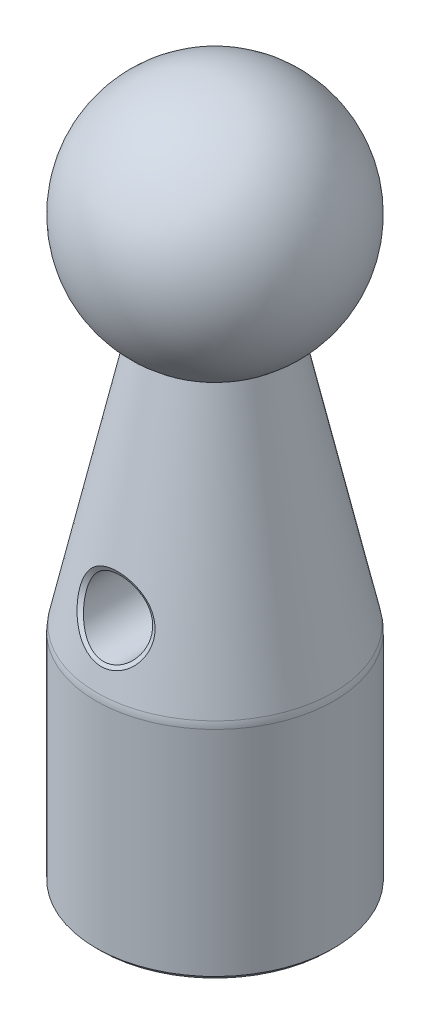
ISO-10303-21;
HEADER;
FILE_DESCRIPTION(('STEP AP214'),'2;1');
FILE_NAME('part.step','',(''),(''),'','','');
FILE_SCHEMA(('AUTOMOTIVE_DESIGN { 1 0 10303 214 1 1 1 1 }'));
ENDSEC;
DATA;
#1=APPLICATION_CONTEXT('core data for automotive mechanical design processes');
#2=APPLICATION_PROTOCOL_DEFINITION('international standard','automotive_design',2000,#1);
#3=PRODUCT_CONTEXT('',#1,'mechanical');
#4=PRODUCT('Part','Part','',(#3));
#5=PRODUCT_RELATED_PRODUCT_CATEGORY('part','',(#4));
#6=PRODUCT_DEFINITION_FORMATION('','',#4);
#7=PRODUCT_DEFINITION_CONTEXT('part definition',#1,'design');
#8=PRODUCT_DEFINITION('design','',#6,#7);
#9=PRODUCT_DEFINITION_SHAPE('','',#8);
#10=(LENGTH_UNIT() NAMED_UNIT(*) SI_UNIT(.MILLI.,.METRE.));
#11=(NAMED_UNIT(*) PLANE_ANGLE_UNIT() SI_UNIT($,.RADIAN.));
#12=(NAMED_UNIT(*) SI_UNIT($,.STERADIAN.) SOLID_ANGLE_UNIT());
#13=UNCERTAINTY_MEASURE_WITH_UNIT(LENGTH_MEASURE(1.E-05),#10,'distance_accuracy_value','');
#14=(GEOMETRIC_REPRESENTATION_CONTEXT(3) GLOBAL_UNCERTAINTY_ASSIGNED_CONTEXT((#13)) GLOBAL_UNIT_ASSIGNED_CONTEXT((#10,
#11,#12)) REPRESENTATION_CONTEXT('',''));
#15=CARTESIAN_POINT('',(0.,0.,0.));
#16=DIRECTION('',(0.,0.,1.));
#17=DIRECTION('',(1.,0.,0.));
#18=AXIS2_PLACEMENT_3D('',#15,#16,#17);
#19=CARTESIAN_POINT('',(0.,0.,0.));
#20=DIRECTION('',(0.,-1.,0.));
#21=DIRECTION('',(0.,0.,-1.));
#22=AXIS2_PLACEMENT_3D('',#19,#20,#21);
#23=PLANE('',#22);
#24=CARTESIAN_POINT('',(0.,0.,0.));
#25=DIRECTION('',(0.,-1.,0.));
#26=DIRECTION('',(0.,0.,-1.));
#27=AXIS2_PLACEMENT_3D('',#24,#25,#26);
#28=CIRCLE('',#27,9.144);
#29=CARTESIAN_POINT('',(0.,0.,-9.144));
#30=VERTEX_POINT('',#29);
#31=EDGE_CURVE('E193',#30,#30,#28,.T.);
#32=ORIENTED_EDGE('',*,*,#31,.T.);
#33=EDGE_LOOP('',(#32));
#34=FACE_BOUND('',#33,.T.);
#35=CARTESIAN_POINT('',(0.,0.,0.));
#36=DIRECTION('',(0.,-1.,0.));
#37=DIRECTION('',(0.,0.,-1.));
#38=AXIS2_PLACEMENT_3D('',#35,#36,#37);
#39=CIRCLE('',#38,6.35);
#40=CARTESIAN_POINT('',(0.,0.,-6.35));
#41=VERTEX_POINT('',#40);
#42=EDGE_CURVE('E64',#41,#41,#39,.T.);
#43=ORIENTED_EDGE('',*,*,#42,.F.);
#44=EDGE_LOOP('',(#43));
#45=FACE_BOUND('',#44,.T.);
#46=ADVANCED_FACE('F37',(#34,#45),#23,.T.);
#47=CARTESIAN_POINT('',(0.,0.,0.));
#48=DIRECTION('',(0.,-1.,0.));
#49=DIRECTION('',(0.,0.,-1.));
#50=AXIS2_PLACEMENT_3D('',#47,#48,#49);
#51=CYLINDRICAL_SURFACE('',#50,9.525);
#52=CARTESIAN_POINT('',(0.,17.5026292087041,0.));
#53=DIRECTION('',(0.,1.,0.));
#54=DIRECTION('',(0.,0.,1.));
#55=AXIS2_PLACEMENT_3D('',#52,#53,#54);
#56=CIRCLE('',#55,9.525);
#57=CARTESIAN_POINT('',(0.,17.5026292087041,9.525));
#58=VERTEX_POINT('',#57);
#59=EDGE_CURVE('E43',#58,#58,#56,.F.);
#60=ORIENTED_EDGE('',*,*,#59,.T.);
#61=EDGE_LOOP('',(#60));
#62=FACE_BOUND('',#61,.T.);
#63=CARTESIAN_POINT('',(0.,0.381000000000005,0.));
#64=DIRECTION('',(0.,-1.,0.));
#65=DIRECTION('',(0.,0.,-1.));
#66=AXIS2_PLACEMENT_3D('',#63,#64,#65);
#67=CIRCLE('',#66,9.525);
#68=CARTESIAN_POINT('',(0.,0.381000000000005,-9.525));
#69=VERTEX_POINT('',#68);
#70=EDGE_CURVE('E201',#69,#69,#67,.F.);
#71=ORIENTED_EDGE('',*,*,#70,.T.);
#72=EDGE_LOOP('',(#71));
#73=FACE_BOUND('',#72,.T.);
#74=ADVANCED_FACE('F187',(#62,#73),#51,.T.);
#75=CARTESIAN_POINT('',(0.,17.78,0.));
#76=DIRECTION('',(0.,-1.,0.));
#77=DIRECTION('',(0.,0.,-1.));
#78=AXIS2_PLACEMENT_3D('',#75,#76,#77);
#79=CONICAL_SURFACE('',#78,9.525,0.217540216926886);
#80=CARTESIAN_POINT('',(0.,18.0508335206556,0.));
#81=DIRECTION('',(0.,1.,0.));
#82=DIRECTION('',(0.,0.,1.));
#83=AXIS2_PLACEMENT_3D('',#80,#81,#82);
#84=CIRCLE('',#83,9.4651354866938);
#85=CARTESIAN_POINT('',(0.,18.0508335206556,9.4651354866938));
#86=VERTEX_POINT('',#85);
#87=EDGE_CURVE('E12',#86,#86,#84,.T.);
#88=ORIENTED_EDGE('',*,*,#87,.T.);
#89=EDGE_LOOP('',(#88));
#90=FACE_BOUND('',#89,.T.);
#91=CARTESIAN_POINT('',(-2.16574098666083,20.5716040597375,8.64066701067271));
#92=CARTESIAN_POINT('',(-1.63110741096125,20.0334121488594,8.8992910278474));
#93=CARTESIAN_POINT('',(-0.850260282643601,19.6889659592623,9.09973912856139));
#94=CARTESIAN_POINT('',(0.780079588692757,19.6698379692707,9.110445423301));
#95=CARTESIAN_POINT('',(1.56445408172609,19.9948996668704,8.92050713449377));
#96=CARTESIAN_POINT('',(2.65991978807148,21.0438115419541,8.41109568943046));
#97=CARTESIAN_POINT('',(2.99644900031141,21.7650303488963,8.11023459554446));
#98=CARTESIAN_POINT('',(3.06492684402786,23.3067077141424,7.71629279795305));
#99=CARTESIAN_POINT('',(2.76295276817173,24.1111669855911,7.65673993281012));
#100=CARTESIAN_POINT('',(1.64858285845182,25.2607208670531,7.71999163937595));
#101=CARTESIAN_POINT('',(0.851139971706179,25.6042588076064,7.79163842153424));
#102=CARTESIAN_POINT('',(-0.776465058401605,25.62276664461,7.79517394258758));
#103=CARTESIAN_POINT('',(-1.58261807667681,25.2990407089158,7.72621323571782));
#104=CARTESIAN_POINT('',(-2.72892700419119,24.1738189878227,7.65567655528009));
#105=CARTESIAN_POINT('',(-3.04775931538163,23.3764001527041,7.70637557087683));
#106=CARTESIAN_POINT('',(-3.01754042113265,21.8373751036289,8.08502125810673));
#107=CARTESIAN_POINT('',(-2.70037456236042,21.1097959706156,8.38204299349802));
#108=CARTESIAN_POINT('',(-2.16574098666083,20.5716040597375,8.64066701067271));
#109=B_SPLINE_CURVE_WITH_KNOTS('',3,(#91,#92,#93,#94,#95,#96,#97,#98,#99,#100,#101,#102,#103,
#104,#105,#106,#107,#108),.UNSPECIFIED.,.T.,.F.,(4,2,2,2,2,2,2,2,4),(-0.0188502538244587,
-0.016480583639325,-0.0141109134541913,-0.0117412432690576,-0.00937157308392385,
-0.00700190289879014,-0.00463223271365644,-0.00226256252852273,0.000107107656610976),.UNSPECIFIED.);
#110=CARTESIAN_POINT('',(-2.16574098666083,20.5716040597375,8.64066701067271));
#111=VERTEX_POINT('',#110);
#112=EDGE_CURVE('E133',#111,#111,#109,.F.);
#113=ORIENTED_EDGE('',*,*,#112,.T.);
#114=EDGE_LOOP('',(#113));
#115=FACE_BOUND('',#114,.T.);
#116=CARTESIAN_POINT('',(-2.16577837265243,20.5715723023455,-8.64066487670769));
#117=CARTESIAN_POINT('',(-2.69886558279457,21.1075533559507,-8.38308124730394));
#118=CARTESIAN_POINT('',(-3.0193195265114,21.837934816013,-8.08419906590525));
#119=CARTESIAN_POINT('',(-3.04632087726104,23.3857042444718,-7.70473130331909));
#120=CARTESIAN_POINT('',(-2.7228543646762,24.1817388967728,-7.65580023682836));
#121=CARTESIAN_POINT('',(-1.57593556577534,25.3039308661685,-7.7267191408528));
#122=CARTESIAN_POINT('',(-0.769490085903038,25.6259083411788,-7.79562132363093));
#123=CARTESIAN_POINT('',(0.859142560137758,25.6010738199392,-7.79112165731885));
#124=CARTESIAN_POINT('',(1.65544808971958,25.2566333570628,-7.7192983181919));
#125=CARTESIAN_POINT('',(2.77114448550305,24.0999081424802,-7.65663541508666));
#126=CARTESIAN_POINT('',(3.06647734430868,23.2943442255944,-7.71856798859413));
#127=CARTESIAN_POINT('',(2.99439231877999,21.7604258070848,-8.11216938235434));
#128=CARTESIAN_POINT('',(2.65882039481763,21.0413110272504,-8.41205397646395));
#129=CARTESIAN_POINT('',(1.55910535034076,19.9911435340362,-8.92254254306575));
#130=CARTESIAN_POINT('',(0.766981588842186,19.6671587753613,-9.11205523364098));
#131=CARTESIAN_POINT('',(-0.861321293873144,19.6919384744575,-9.09795534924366));
#132=CARTESIAN_POINT('',(-1.63269116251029,20.0355912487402,-8.89824850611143));
#133=CARTESIAN_POINT('',(-2.16577837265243,20.5715723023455,-8.64066487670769));
#134=B_SPLINE_CURVE_WITH_KNOTS('',3,(#116,#117,#118,#119,#120,#121,#122,#123,#124,#125,#126,
#127,#128,#129,#130,#131,#132,#133),.UNSPECIFIED.,.T.,.F.,(4,2,2,2,2,2,2,2,4),
(-0.0185591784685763,-0.0161978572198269,-0.0138365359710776,-0.0114752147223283,
-0.00911389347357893,-0.0067525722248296,-0.00439125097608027,-0.00202992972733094,
0.000331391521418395),.UNSPECIFIED.);
#135=CARTESIAN_POINT('',(-2.16577837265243,20.5715723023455,-8.64066487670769));
#136=VERTEX_POINT('',#135);
#137=EDGE_CURVE('E174',#136,#136,#134,.F.);
#138=ORIENTED_EDGE('',*,*,#137,.T.);
#139=EDGE_LOOP('',(#138));
#140=FACE_BOUND('',#139,.T.);
#141=CARTESIAN_POINT('',(0.,38.354,0.));
#142=DIRECTION('',(0.,-1.,0.));
#143=DIRECTION('',(0.,0.,-1.));
#144=AXIS2_PLACEMENT_3D('',#141,#142,#143);
#145=CIRCLE('',#144,4.97736315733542);
#146=CARTESIAN_POINT('',(0.,38.354,-4.97736315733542));
#147=VERTEX_POINT('',#146);
#148=EDGE_CURVE('E70',#147,#147,#145,.T.);
#149=ORIENTED_EDGE('',*,*,#148,.T.);
#150=EDGE_LOOP('',(#149));
#151=FACE_BOUND('',#150,.T.);
#152=ADVANCED_FACE('F179',(#90,#115,#140,#151),#79,.T.);
#153=CARTESIAN_POINT('',(0.,46.4750517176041,0.));
#154=DIRECTION('',(0.,-1.,0.));
#155=DIRECTION('',(1.,0.,0.));
#156=AXIS2_PLACEMENT_3D('',#153,#154,#155);
#157=SPHERICAL_SURFACE('',#156,9.525);
#158=ORIENTED_EDGE('',*,*,#148,.F.);
#159=EDGE_LOOP('',(#158));
#160=FACE_BOUND('',#159,.T.);
#161=ADVANCED_FACE('F159',(#160),#157,.T.);
#162=CARTESIAN_POINT('',(0.,22.606,-9.525));
#163=DIRECTION('',(0.,0.,1.));
#164=DIRECTION('',(1.,0.,0.));
#165=AXIS2_PLACEMENT_3D('',#162,#163,#164);
#166=CYLINDRICAL_SURFACE('',#165,2.667);
#167=CARTESIAN_POINT('',(-1.90657382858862,20.741096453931,8.46307114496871));
#168=CARTESIAN_POINT('',(-1.93596278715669,20.771336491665,8.4470870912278));
#169=CARTESIAN_POINT('',(-1.96459402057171,20.8022342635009,8.43095741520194));
#170=CARTESIAN_POINT('',(-2.02032003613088,20.86529448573,8.39846927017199));
#171=CARTESIAN_POINT('',(-2.04741422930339,20.8974574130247,8.38211071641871));
#172=CARTESIAN_POINT('',(-2.10002984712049,20.9629828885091,8.34923510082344));
#173=CARTESIAN_POINT('',(-2.1255508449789,20.9963457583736,8.33271799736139));
#174=CARTESIAN_POINT('',(-2.17498399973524,21.0642068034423,8.29959523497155));
#175=CARTESIAN_POINT('',(-2.19889597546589,21.098705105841,8.28298956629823));
#176=CARTESIAN_POINT('',(-2.24507483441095,21.168772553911,8.24975973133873));
#177=CARTESIAN_POINT('',(-2.26734184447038,21.2043416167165,8.23313556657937));
#178=CARTESIAN_POINT('',(-2.31019448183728,21.2764861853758,8.19993879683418));
#179=CARTESIAN_POINT('',(-2.33078058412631,21.3130614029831,8.18336617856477));
#180=CARTESIAN_POINT('',(-2.37023506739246,21.3871538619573,8.15034259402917));
#181=CARTESIAN_POINT('',(-2.38910428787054,21.4246706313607,8.13389157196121));
#182=CARTESIAN_POINT('',(-2.42508865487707,21.5005817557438,8.10118129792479));
#183=CARTESIAN_POINT('',(-2.44220499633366,21.5389754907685,8.08492192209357));
#184=CARTESIAN_POINT('',(-2.47464725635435,21.6165760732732,8.05266508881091));
#185=CARTESIAN_POINT('',(-2.48997468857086,21.6557821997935,8.03666741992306));
#186=CARTESIAN_POINT('',(-2.51880283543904,21.734943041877,8.00500415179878));
#187=CARTESIAN_POINT('',(-2.53230531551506,21.7748969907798,7.98933824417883));
#188=CARTESIAN_POINT('',(-2.55744726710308,21.8554889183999,7.95840871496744));
#189=CARTESIAN_POINT('',(-2.56908865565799,21.8961261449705,7.94314469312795));
#190=CARTESIAN_POINT('',(-2.5904724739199,21.9780199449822,7.91308892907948));
#191=CARTESIAN_POINT('',(-2.6002168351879,22.0192758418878,7.89829671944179));
#192=CARTESIAN_POINT('',(-2.61776989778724,22.1023424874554,7.86925534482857));
#193=CARTESIAN_POINT('',(-2.62558036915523,22.1441526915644,7.85500569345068));
#194=CARTESIAN_POINT('',(-2.63923244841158,22.2282624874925,7.82711716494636));
#195=CARTESIAN_POINT('',(-2.64507544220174,22.2705617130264,7.81347786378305));
#196=CARTESIAN_POINT('',(-2.65474722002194,22.3555874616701,7.78688879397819));
#197=CARTESIAN_POINT('',(-2.65857674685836,22.3983138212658,7.77393877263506));
#198=CARTESIAN_POINT('',(-2.66422263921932,22.4841189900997,7.74876544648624));
#199=CARTESIAN_POINT('',(-2.66603878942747,22.5271978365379,7.73654221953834));
#200=CARTESIAN_POINT('',(-2.66748583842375,22.6136026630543,7.71303543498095));
#201=CARTESIAN_POINT('',(-2.66711906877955,22.6569283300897,7.70175088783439));
#202=CARTESIAN_POINT('',(-2.66409147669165,22.7436665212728,7.68024435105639));
#203=CARTESIAN_POINT('',(-2.66143545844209,22.7870786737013,7.67002018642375));
#204=CARTESIAN_POINT('',(-2.65390230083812,22.8738656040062,7.65057582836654));
#205=CARTESIAN_POINT('',(-2.64902846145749,22.9172403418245,7.6413541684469));
#206=CARTESIAN_POINT('',(-2.63708603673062,23.0038393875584,7.62389833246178));
#207=CARTESIAN_POINT('',(-2.6300196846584,23.0470638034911,7.61566316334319));
#208=CARTESIAN_POINT('',(-2.61373058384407,23.1332463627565,7.60015278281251));
#209=CARTESIAN_POINT('',(-2.60450928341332,23.1762046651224,7.59287693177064));
#210=CARTESIAN_POINT('',(-2.58394504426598,23.2617400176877,7.57926078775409));
#211=CARTESIAN_POINT('',(-2.5726030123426,23.3043172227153,7.57292009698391));
#212=CARTESIAN_POINT('',(-2.54783271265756,23.3889752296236,7.56114917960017));
#213=CARTESIAN_POINT('',(-2.53440499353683,23.4310561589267,7.55571871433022));
#214=CARTESIAN_POINT('',(-2.50549830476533,23.5146065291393,7.5457434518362));
#215=CARTESIAN_POINT('',(-2.49001965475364,23.5560760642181,7.54119851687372));
#216=CARTESIAN_POINT('',(-2.45704602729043,23.6382885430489,7.53296950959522));
#217=CARTESIAN_POINT('',(-2.43955121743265,23.6790315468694,7.5292853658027));
#218=CARTESIAN_POINT('',(-2.40258009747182,23.7596758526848,7.52275321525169));
#219=CARTESIAN_POINT('',(-2.38310383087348,23.7995771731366,7.51990519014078));
#220=CARTESIAN_POINT('',(-2.34220461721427,23.8784230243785,7.51502044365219));
#221=CARTESIAN_POINT('',(-2.32078157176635,23.9173675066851,7.5129837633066));
#222=CARTESIAN_POINT('',(-2.27602358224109,23.9941845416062,7.5096973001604));
#223=CARTESIAN_POINT('',(-2.25268833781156,24.0320569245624,7.50844764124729));
#224=CARTESIAN_POINT('',(-2.20414099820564,24.1066149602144,7.50670917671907));
#225=CARTESIAN_POINT('',(-2.17892830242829,24.1433002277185,7.50622061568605));
#226=CARTESIAN_POINT('',(-2.12666043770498,24.2153682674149,7.50598429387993));
#227=CARTESIAN_POINT('',(-2.09960423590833,24.2507502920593,7.50623695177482));
#228=CARTESIAN_POINT('',(-2.04368673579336,24.3201001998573,7.50744044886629));
#229=CARTESIAN_POINT('',(-2.01482381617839,24.3540667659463,7.50839192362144));
#230=CARTESIAN_POINT('',(-1.9553196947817,24.4204595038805,7.51103451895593));
#231=CARTESIAN_POINT('',(-1.92467609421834,24.4528834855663,7.51272665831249));
#232=CARTESIAN_POINT('',(-1.86172842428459,24.5160695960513,7.51657424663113));
#233=CARTESIAN_POINT('',(-1.82942372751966,24.5468310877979,7.51872987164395));
#234=CARTESIAN_POINT('',(-1.76332486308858,24.606642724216,7.52320449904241));
#235=CARTESIAN_POINT('',(-1.7295318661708,24.6356941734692,7.52552337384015));
#236=CARTESIAN_POINT('',(-1.66054534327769,24.6920328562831,7.53034146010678));
#237=CARTESIAN_POINT('',(-1.62535249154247,24.7193209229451,7.53284058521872));
#238=CARTESIAN_POINT('',(-1.55366492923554,24.7720953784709,7.53795187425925));
#239=CARTESIAN_POINT('',(-1.51717059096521,24.7975822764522,7.5405640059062));
#240=CARTESIAN_POINT('',(-1.4429758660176,24.8467125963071,7.54585661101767));
#241=CARTESIAN_POINT('',(-1.40527569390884,24.8703563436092,7.54853707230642));
#242=CARTESIAN_POINT('',(-1.32876569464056,24.9157595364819,7.55391561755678));
#243=CARTESIAN_POINT('',(-1.28995601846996,24.9375192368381,7.5566136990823));
#244=CARTESIAN_POINT('',(-1.21132312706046,24.9791130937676,7.56197839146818));
#245=CARTESIAN_POINT('',(-1.17150005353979,24.9989475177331,7.56464500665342));
#246=CARTESIAN_POINT('',(-1.09093648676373,25.0366495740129,7.56989723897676));
#247=CARTESIAN_POINT('',(-1.05019614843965,25.0545175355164,7.57248286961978));
#248=CARTESIAN_POINT('',(-0.967894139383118,25.0882453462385,7.57752371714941));
#249=CARTESIAN_POINT('',(-0.9263326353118,25.1041055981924,7.5799789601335));
#250=CARTESIAN_POINT('',(-0.842484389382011,25.1337766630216,7.58470958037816));
#251=CARTESIAN_POINT('',(-0.800197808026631,25.1475879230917,7.58698499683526));
#252=CARTESIAN_POINT('',(-0.714995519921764,25.1731197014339,7.5913065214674));
#253=CARTESIAN_POINT('',(-0.672079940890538,25.1848406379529,7.59335267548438));
#254=CARTESIAN_POINT('',(-0.585715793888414,25.2061505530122,7.59716623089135));
#255=CARTESIAN_POINT('',(-0.542267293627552,25.2157397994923,7.59893366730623));
#256=CARTESIAN_POINT('',(-0.454933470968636,25.232745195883,7.60214038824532));
#257=CARTESIAN_POINT('',(-0.411048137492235,25.2401612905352,7.60357966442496));
#258=CARTESIAN_POINT('',(-0.322936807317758,25.2527795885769,7.60608060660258));
#259=CARTESIAN_POINT('',(-0.278710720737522,25.2579811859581,7.6071421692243));
#260=CARTESIAN_POINT('',(-0.190014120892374,25.2661292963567,7.6088386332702));
#261=CARTESIAN_POINT('',(-0.145543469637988,25.2690743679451,7.60947326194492));
#262=CARTESIAN_POINT('',(-0.0564536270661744,25.2726708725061,7.61026557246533));
#263=CARTESIAN_POINT('',(-0.0118343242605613,25.2733196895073,7.61042271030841));
#264=CARTESIAN_POINT('',(0.0773747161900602,25.2722776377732,7.61021496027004));
#265=CARTESIAN_POINT('',(0.121964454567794,25.270586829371,7.60985008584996));
#266=CARTESIAN_POINT('',(0.21093624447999,25.2648980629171,7.60865298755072));
#267=CARTESIAN_POINT('',(0.255318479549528,25.2609028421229,7.60782131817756));
#268=CARTESIAN_POINT('',(0.343780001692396,25.2506538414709,7.60574198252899));
#269=CARTESIAN_POINT('',(0.387859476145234,25.2444016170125,7.60449460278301));
#270=CARTESIAN_POINT('',(0.47561994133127,25.229684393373,7.60163637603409));
#271=CARTESIAN_POINT('',(0.519301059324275,25.2212201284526,7.60002564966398));
#272=CARTESIAN_POINT('',(0.606169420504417,25.2021248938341,7.59649281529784));
#273=CARTESIAN_POINT('',(0.649356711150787,25.1914941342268,7.5945707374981));
#274=CARTESIAN_POINT('',(0.735142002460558,25.1681115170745,7.59046731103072));
#275=CARTESIAN_POINT('',(0.777739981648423,25.1553595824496,7.58828595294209));
#276=CARTESIAN_POINT('',(0.862251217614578,25.1277800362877,7.58371600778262));
#277=CARTESIAN_POINT('',(0.90416441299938,25.1129522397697,7.58132740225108));
#278=CARTESIAN_POINT('',(0.987210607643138,25.0812662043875,7.57639498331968));
#279=CARTESIAN_POINT('',(1.02834354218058,25.0644077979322,7.57385115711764));
#280=CARTESIAN_POINT('',(1.10973369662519,25.0287056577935,7.5686603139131));
#281=CARTESIAN_POINT('',(1.1499908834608,25.0098618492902,7.56601329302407));
#282=CARTESIAN_POINT('',(1.22953398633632,24.9702339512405,7.56066804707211));
#283=CARTESIAN_POINT('',(1.2688199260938,24.9494499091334,7.55796982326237));
#284=CARTESIAN_POINT('',(1.34632493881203,24.9059865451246,7.55257427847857));
#285=CARTESIAN_POINT('',(1.38454409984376,24.8833073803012,7.54987695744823));
#286=CARTESIAN_POINT('',(1.45981999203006,24.8360988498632,7.54453490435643));
#287=CARTESIAN_POINT('',(1.49687685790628,24.8115696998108,7.5418901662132));
#288=CARTESIAN_POINT('',(1.56973245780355,24.7607060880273,7.53670656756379));
#289=CARTESIAN_POINT('',(1.60553132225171,24.7343718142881,7.53416769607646));
#290=CARTESIAN_POINT('',(1.67577585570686,24.6799438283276,7.52924315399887));
#291=CARTESIAN_POINT('',(1.71022155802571,24.6518501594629,7.52685747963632));
#292=CARTESIAN_POINT('',(1.77766261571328,24.5939460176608,7.52230889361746));
#293=CARTESIAN_POINT('',(1.81065776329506,24.5641353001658,7.52014601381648));
#294=CARTESIAN_POINT('',(1.87510886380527,24.5028523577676,7.51602948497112));
#295=CARTESIAN_POINT('',(1.90656416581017,24.4713794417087,7.5140759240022));
#296=CARTESIAN_POINT('',(1.96778419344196,24.4068148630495,7.51067641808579));
#297=CARTESIAN_POINT('',(1.99754930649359,24.3737235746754,7.50923035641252));
#298=CARTESIAN_POINT('',(2.05529188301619,24.3060355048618,7.50711529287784));
#299=CARTESIAN_POINT('',(2.08327065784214,24.271439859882,7.50644571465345));
#300=CARTESIAN_POINT('',(2.13741317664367,24.2008687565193,7.50583928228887));
#301=CARTESIAN_POINT('',(2.16357748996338,24.1648937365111,7.50590219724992));
#302=CARTESIAN_POINT('',(2.21405464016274,24.0916774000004,7.50679964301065));
#303=CARTESIAN_POINT('',(2.23836749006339,24.0544360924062,7.50763416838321));
#304=CARTESIAN_POINT('',(2.28510744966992,23.9788036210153,7.51009155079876));
#305=CARTESIAN_POINT('',(2.30753417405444,23.9404122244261,7.51171456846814));
#306=CARTESIAN_POINT('',(2.3504668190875,23.8625949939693,7.51577167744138));
#307=CARTESIAN_POINT('',(2.37097208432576,23.8231688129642,7.51820604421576));
#308=CARTESIAN_POINT('',(2.41002678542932,23.7433975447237,7.52390705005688));
#309=CARTESIAN_POINT('',(2.42857538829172,23.7030520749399,7.52717404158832));
#310=CARTESIAN_POINT('',(2.46368159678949,23.6215576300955,7.53456196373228));
#311=CARTESIAN_POINT('',(2.48023824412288,23.5804082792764,7.53868330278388));
#312=CARTESIAN_POINT('',(2.51132533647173,23.4974214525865,7.54780148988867));
#313=CARTESIAN_POINT('',(2.52585470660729,23.4555836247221,7.55279879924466));
#314=CARTESIAN_POINT('',(2.5528520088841,23.3713352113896,7.56369054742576));
#315=CARTESIAN_POINT('',(2.56531871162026,23.3289243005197,7.56958551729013));
#316=CARTESIAN_POINT('',(2.58815554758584,23.2436450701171,7.58229412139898));
#317=CARTESIAN_POINT('',(2.59852420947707,23.2007764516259,7.58910839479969));
#318=CARTESIAN_POINT('',(2.61712967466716,23.1146972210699,7.60367733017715));
#319=CARTESIAN_POINT('',(2.62536462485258,23.0714863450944,7.61143280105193));
#320=CARTESIAN_POINT('',(2.63966843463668,22.984837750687,7.62790494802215));
#321=CARTESIAN_POINT('',(2.64573486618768,22.9413998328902,7.63662268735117));
#322=CARTESIAN_POINT('',(2.65566417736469,22.8544132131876,7.6550432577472));
#323=CARTESIAN_POINT('',(2.65952379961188,22.8108644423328,7.6647475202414));
#324=CARTESIAN_POINT('',(2.66501509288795,22.7237685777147,7.68515310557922));
#325=CARTESIAN_POINT('',(2.6666423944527,22.6802216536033,7.69585634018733));
#326=CARTESIAN_POINT('',(2.66759701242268,22.5932550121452,7.71831588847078));
#327=CARTESIAN_POINT('',(2.66691837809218,22.549835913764,7.73007485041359));
#328=CARTESIAN_POINT('',(2.66337275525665,22.4632915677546,7.75451058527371));
#329=CARTESIAN_POINT('',(2.6605029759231,22.4201667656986,7.76718851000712));
#330=CARTESIAN_POINT('',(2.65275175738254,22.3343221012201,7.79323857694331));
#331=CARTESIAN_POINT('',(2.64787077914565,22.2916021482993,7.80661055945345));
#332=CARTESIAN_POINT('',(2.63609916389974,22.2066433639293,7.83401097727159));
#333=CARTESIAN_POINT('',(2.62920814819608,22.1644046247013,7.84803953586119));
#334=CARTESIAN_POINT('',(2.61346620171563,22.0804693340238,7.87667163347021));
#335=CARTESIAN_POINT('',(2.60461435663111,22.0387730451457,7.89127543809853));
#336=CARTESIAN_POINT('',(2.58498731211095,21.955987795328,7.92098844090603));
#337=CARTESIAN_POINT('',(2.57421091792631,21.9148992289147,7.93609794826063));
#338=CARTESIAN_POINT('',(2.55077453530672,21.833393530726,7.96674971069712));
#339=CARTESIAN_POINT('',(2.53811328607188,21.7929768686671,7.98229224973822));
#340=CARTESIAN_POINT('',(2.51094582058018,21.7128794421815,8.01373833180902));
#341=CARTESIAN_POINT('',(2.49643844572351,21.6731991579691,8.02964209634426));
#342=CARTESIAN_POINT('',(2.46561744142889,21.5946389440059,8.06173868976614));
#343=CARTESIAN_POINT('',(2.44930288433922,21.5557594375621,8.07793166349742));
#344=CARTESIAN_POINT('',(2.41490603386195,21.4788653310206,8.11053480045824));
#345=CARTESIAN_POINT('',(2.39682313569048,21.4408510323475,8.12694503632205));
#346=CARTESIAN_POINT('',(2.35892806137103,21.3657519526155,8.15991080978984));
#347=CARTESIAN_POINT('',(2.33911566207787,21.328667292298,8.17646636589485));
#348=CARTESIAN_POINT('',(2.29779994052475,21.2554921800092,8.2096508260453));
#349=CARTESIAN_POINT('',(2.27629680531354,21.2194016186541,8.22627972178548));
#350=CARTESIAN_POINT('',(2.23163809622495,21.1482793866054,8.25953905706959));
#351=CARTESIAN_POINT('',(2.20848312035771,21.1132473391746,8.27616949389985));
#352=CARTESIAN_POINT('',(2.1605586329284,21.0443070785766,8.30935939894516));
#353=CARTESIAN_POINT('',(2.13579010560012,21.0103981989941,8.325918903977));
#354=CARTESIAN_POINT('',(2.08467860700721,20.9437684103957,8.35889691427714));
#355=CARTESIAN_POINT('',(2.0583369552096,20.9110465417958,8.37531552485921));
#356=CARTESIAN_POINT('',(2.00411128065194,20.8468580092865,8.40793230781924));
#357=CARTESIAN_POINT('',(1.97622884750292,20.8153901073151,8.4241306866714));
#358=CARTESIAN_POINT('',(1.91898381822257,20.7537651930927,8.45626248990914));
#359=CARTESIAN_POINT('',(1.88962295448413,20.7236067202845,8.47219619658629));
#360=CARTESIAN_POINT('',(1.8293546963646,20.6646829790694,8.50363261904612));
#361=CARTESIAN_POINT('',(1.79844832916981,20.6359168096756,8.519135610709));
#362=CARTESIAN_POINT('',(1.73507308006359,20.5798517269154,8.54955506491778));
#363=CARTESIAN_POINT('',(1.70260462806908,20.5525524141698,8.56447168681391));
#364=CARTESIAN_POINT('',(1.63621653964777,20.4994711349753,8.59368323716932));
#365=CARTESIAN_POINT('',(1.60229775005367,20.4736883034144,8.60797851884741));
#366=CARTESIAN_POINT('',(1.53309099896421,20.4237023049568,8.63587696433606));
#367=CARTESIAN_POINT('',(1.49780426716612,20.3994977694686,8.64948072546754));
#368=CARTESIAN_POINT('',(1.42595154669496,20.3527274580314,8.67593509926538));
#369=CARTESIAN_POINT('',(1.38938708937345,20.3301598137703,8.68878656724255));
#370=CARTESIAN_POINT('',(1.31506680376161,20.2867232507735,8.71367277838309));
#371=CARTESIAN_POINT('',(1.27731271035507,20.2658520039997,8.7257086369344));
#372=CARTESIAN_POINT('',(1.20070169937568,20.2258679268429,8.74890073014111));
#373=CARTESIAN_POINT('',(1.16184660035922,20.2067523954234,8.76005831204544));
#374=CARTESIAN_POINT('',(1.08312208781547,20.1703394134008,8.78143080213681));
#375=CARTESIAN_POINT('',(1.04325444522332,20.1530390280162,8.79164722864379));
#376=CARTESIAN_POINT('',(0.96259352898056,20.1203158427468,8.81107447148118));
#377=CARTESIAN_POINT('',(0.921801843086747,20.1048900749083,8.82028687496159));
#378=CARTESIAN_POINT('',(0.839381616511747,20.075975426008,8.83764323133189));
#379=CARTESIAN_POINT('',(0.797754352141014,20.0624838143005,8.84578868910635));
#380=CARTESIAN_POINT('',(0.713751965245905,20.0374965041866,8.8609484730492));
#381=CARTESIAN_POINT('',(0.671377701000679,20.0259986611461,8.86796401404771));
#382=CARTESIAN_POINT('',(0.585970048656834,20.0050575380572,8.88080151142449));
#383=CARTESIAN_POINT('',(0.542937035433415,19.9956131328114,8.88662412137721));
#384=CARTESIAN_POINT('',(0.456302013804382,19.9788371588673,8.89701354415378));
#385=CARTESIAN_POINT('',(0.412699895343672,19.9715060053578,8.90158011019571));
#386=CARTESIAN_POINT('',(0.325011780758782,19.9590140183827,8.90939574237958));
#387=CARTESIAN_POINT('',(0.280925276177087,19.9538557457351,8.91264325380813));
#388=CARTESIAN_POINT('',(0.214551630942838,19.9477932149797,8.91647760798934));
#389=CARTESIAN_POINT('',(0.192367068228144,19.9460507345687,8.9175834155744));
#390=CARTESIAN_POINT('',(0.14791067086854,19.9431300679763,8.91944243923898));
#391=CARTESIAN_POINT('',(0.125638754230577,19.9419527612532,8.92019510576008));
#392=CARTESIAN_POINT('',(0.0810196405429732,19.940169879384,8.92134001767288));
#393=CARTESIAN_POINT('',(0.0586723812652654,19.9395654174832,8.92173156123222));
#394=CARTESIAN_POINT('',(0.01391338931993,19.9389350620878,8.92214663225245));
#395=CARTESIAN_POINT('',(-0.0084983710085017,19.9389105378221,8.9221692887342));
#396=CARTESIAN_POINT('',(-0.0533187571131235,19.9394476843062,8.921839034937));
#397=CARTESIAN_POINT('',(-0.0757273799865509,19.9400095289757,8.92148601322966));
#398=CARTESIAN_POINT('',(-0.120473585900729,19.941714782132,8.92041108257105));
#399=CARTESIAN_POINT('',(-0.142811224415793,19.9428571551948,8.91968983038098));
#400=CARTESIAN_POINT('',(-0.187404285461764,19.9457152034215,8.91788689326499));
#401=CARTESIAN_POINT('',(-0.20965977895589,19.9474300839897,8.91680570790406));
#402=CARTESIAN_POINT('',(-0.254076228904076,19.9514250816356,8.91429137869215));
#403=CARTESIAN_POINT('',(-0.276237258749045,19.9537046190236,8.9128585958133));
#404=CARTESIAN_POINT('',(-0.342544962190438,19.9613775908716,8.90804583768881));
#405=CARTESIAN_POINT('',(-0.38656120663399,19.9676082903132,8.90414960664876));
#406=CARTESIAN_POINT('',(-0.474076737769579,19.9822369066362,8.8950486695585));
#407=CARTESIAN_POINT('',(-0.517576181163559,19.9906341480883,8.88984437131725));
#408=CARTESIAN_POINT('',(-0.603971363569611,20.0095319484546,8.87819437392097));
#409=CARTESIAN_POINT('',(-0.646866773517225,20.0200336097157,8.87174802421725));
#410=CARTESIAN_POINT('',(-0.731962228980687,20.043076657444,8.8576807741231));
#411=CARTESIAN_POINT('',(-0.774161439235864,20.0556203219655,8.85005856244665));
#412=CARTESIAN_POINT('',(-0.857774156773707,20.0826844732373,8.83370599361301));
#413=CARTESIAN_POINT('',(-0.899186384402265,20.0972079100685,8.82497398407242));
#414=CARTESIAN_POINT('',(-0.981134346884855,20.1281691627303,8.80646793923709));
#415=CARTESIAN_POINT('',(-1.02166847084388,20.1446101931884,8.79669215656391));
#416=CARTESIAN_POINT('',(-1.10176939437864,20.1793445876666,8.77616445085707));
#417=CARTESIAN_POINT('',(-1.14133439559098,20.1976411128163,8.76541086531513));
#418=CARTESIAN_POINT('',(-1.21940605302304,20.2360247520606,8.74299327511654));
#419=CARTESIAN_POINT('',(-1.25791087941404,20.256114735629,8.73132781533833));
#420=CARTESIAN_POINT('',(-1.33377100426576,20.2980237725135,8.70715208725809));
#421=CARTESIAN_POINT('',(-1.37112459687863,20.3198452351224,8.69464064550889));
#422=CARTESIAN_POINT('',(-1.44459089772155,20.3651558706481,8.66883849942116));
#423=CARTESIAN_POINT('',(-1.48070216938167,20.3886468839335,8.65554693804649));
#424=CARTESIAN_POINT('',(-1.5515923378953,20.4372353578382,8.62825007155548));
#425=CARTESIAN_POINT('',(-1.58637019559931,20.4623340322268,8.61424422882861));
#426=CARTESIAN_POINT('',(-1.65450183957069,20.5140766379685,8.58558431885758));
#427=CARTESIAN_POINT('',(-1.68785508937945,20.5407211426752,8.57093001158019));
#428=CARTESIAN_POINT('',(-1.7530459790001,20.5954941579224,8.54103872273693));
#429=CARTESIAN_POINT('',(-1.78488366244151,20.6236226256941,8.52580175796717));
#430=CARTESIAN_POINT('',(-1.84695080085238,20.6813025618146,8.49481072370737));
#431=CARTESIAN_POINT('',(-1.87718092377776,20.7108534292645,8.47905687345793));
#432=CARTESIAN_POINT('',(-1.90657382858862,20.741096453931,8.46307114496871));
#433=B_SPLINE_CURVE_WITH_KNOTS('',3,(#167,#168,#169,#170,#171,#172,#173,#174,#175,#176,#177,
#178,#179,#180,#181,#182,#183,#184,#185,#186,#187,#188,#189,#190,#191,#192,#193,#194,#195,#196,
#197,#198,#199,#200,#201,#202,#203,#204,#205,#206,#207,#208,#209,#210,#211,#212,#213,#214,#215,
#216,#217,#218,#219,#220,#221,#222,#223,#224,#225,#226,#227,#228,#229,#230,#231,#232,#233,#234,
#235,#236,#237,#238,#239,#240,#241,#242,#243,#244,#245,#246,#247,#248,#249,#250,#251,#252,#253,
#254,#255,#256,#257,#258,#259,#260,#261,#262,#263,#264,#265,#266,#267,#268,#269,#270,#271,#272,
#273,#274,#275,#276,#277,#278,#279,#280,#281,#282,#283,#284,#285,#286,#287,#288,#289,#290,#291,
#292,#293,#294,#295,#296,#297,#298,#299,#300,#301,#302,#303,#304,#305,#306,#307,#308,#309,#310,
#311,#312,#313,#314,#315,#316,#317,#318,#319,#320,#321,#322,#323,#324,#325,#326,#327,#328,#329,
#330,#331,#332,#333,#334,#335,#336,#337,#338,#339,#340,#341,#342,#343,#344,#345,#346,#347,#348,
#349,#350,#351,#352,#353,#354,#355,#356,#357,#358,#359,#360,#361,#362,#363,#364,#365,#366,#367,
#368,#369,#370,#371,#372,#373,#374,#375,#376,#377,#378,#379,#380,#381,#382,#383,#384,#385,#386,
#387,#388,#389,#390,#391,#392,#393,#394,#395,#396,#397,#398,#399,#400,#401,#402,#403,#404,#405,
#406,#407,#408,#409,#410,#411,#412,#413,#414,#415,#416,#417,#418,#419,#420,#421,#422,#423,#424,
#425,#426,#427,#428,#429,#430,#431,#432),.UNSPECIFIED.,.F.,.F.,(4,2,2,2,2,2,2,2,2,2,2,2,2,2,2,2,
2,2,2,2,2,2,2,2,2,2,2,2,2,2,2,2,2,2,2,2,2,2,2,2,2,2,2,2,2,2,2,2,2,2,2,2,2,2,2,2,2,2,2,2,2,2,2,2,
2,2,2,2,2,2,2,2,2,2,2,2,2,2,2,2,2,2,2,2,2,2,2,2,2,2,2,2,2,2,2,2,2,2,2,2,2,2,2,2,2,2,2,2,2,2,2,2,
2,2,2,2,2,2,2,2,2,2,2,2,2,2,2,2,2,2,2,2,4),(0.,0.135275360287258,0.270602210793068,
0.405965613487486,0.541344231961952,0.676712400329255,0.812042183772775,0.947305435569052,
1.08247585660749,1.21753106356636,1.35245467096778,1.48723839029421,1.62188414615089,
1.75640620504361,1.89083330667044,2.02521078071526,2.15960262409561,2.29385094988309,
2.42781822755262,2.56158681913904,2.69521960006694,2.828762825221,2.9622490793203,
3.0957002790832,3.22913070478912,3.36255004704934,3.49596646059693,3.62938962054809,
3.76283377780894,3.89632080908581,4.02988325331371,4.16356732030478,4.29743584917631,
4.43135531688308,4.56517125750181,4.69892350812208,4.83263779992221,4.96632842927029,
5.10000095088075,5.23365488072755,5.36728640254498,5.50089107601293,5.63446654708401,
5.76801526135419,5.90154717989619,6.03508249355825,6.168654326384,6.3023114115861,
6.43612071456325,6.56992656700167,6.70357380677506,6.83712911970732,6.97064015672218,
7.10413825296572,7.23764120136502,7.37115605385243,7.50468193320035,7.63821284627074,
7.77174049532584,7.90525708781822,8.03875814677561,8.17224532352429,8.30572921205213,
8.43923215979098,8.57279106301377,8.70631922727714,8.83974821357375,8.97313514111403,
9.10652113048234,9.23993430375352,9.37339281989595,9.5069079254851,9.64048700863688,
9.77413664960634,9.90786566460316,10.0416881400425,10.175626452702,10.3097142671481,
10.4439994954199,10.5785471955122,10.7134423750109,10.8485096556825,10.9835459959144,
11.1186077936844,11.2537327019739,11.3889417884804,11.5242417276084,11.6596270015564,
11.7950820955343,11.9305836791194,12.0661027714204,12.2016068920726,12.3370622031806,
12.4724356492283,12.6076971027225,12.7428215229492,12.8777911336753,13.012672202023,
13.1475163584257,13.2822828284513,13.4169308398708,13.5514226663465,13.6857266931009,
13.8198205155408,13.9536940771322,14.0873528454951,14.220821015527,14.354144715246,
14.4873951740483,14.6206717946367,14.7541050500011,14.820937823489,14.8878742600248,
14.9549405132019,15.0221650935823,15.0894096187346,15.1565346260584,15.2235668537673,
15.2905305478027,15.4243228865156,15.5580735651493,15.6918944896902,15.8258657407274,
15.9600388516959,16.0944402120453,16.2290745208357,16.3639282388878,16.4989730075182,
16.6341690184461,16.7694683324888,16.9048181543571,17.0401640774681,17.1754533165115),.UNSPECIFIED.);
#434=CARTESIAN_POINT('',(-1.90657382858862,20.741096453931,8.46307114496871));
#435=VERTEX_POINT('',#434);
#436=EDGE_CURVE('E120',#435,#435,#433,.F.);
#437=ORIENTED_EDGE('',*,*,#436,.T.);
#438=EDGE_LOOP('',(#437));
#439=FACE_BOUND('',#438,.T.);
#440=CARTESIAN_POINT('',(-1.90654623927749,20.7410682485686,-8.46293072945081));
#441=CARTESIAN_POINT('',(-1.87724799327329,20.7109587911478,-8.47884728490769));
#442=CARTESIAN_POINT('',(-1.84713119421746,20.6815269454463,-8.49453815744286));
#443=CARTESIAN_POINT('',(-1.78533745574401,20.624074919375,-8.52540629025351));
#444=CARTESIAN_POINT('',(-1.75366073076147,20.5960545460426,-8.54058362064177));
#445=CARTESIAN_POINT('',(-1.68883134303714,20.5414865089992,-8.57035978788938));
#446=CARTESIAN_POINT('',(-1.65567938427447,20.5149381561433,-8.58495889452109));
#447=CARTESIAN_POINT('',(-1.5879830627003,20.4633756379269,-8.61351356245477));
#448=CARTESIAN_POINT('',(-1.55343984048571,20.4383602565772,-8.62746963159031));
#449=CARTESIAN_POINT('',(-1.48304476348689,20.3899250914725,-8.65467316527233));
#450=CARTESIAN_POINT('',(-1.44719440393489,20.3665035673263,-8.66792139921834));
#451=CARTESIAN_POINT('',(-1.37426885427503,20.3213175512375,-8.69364417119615));
#452=CARTESIAN_POINT('',(-1.33719540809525,20.2995508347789,-8.70611974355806));
#453=CARTESIAN_POINT('',(-1.26190760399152,20.2577358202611,-8.73023210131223));
#454=CARTESIAN_POINT('',(-1.22369511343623,20.2376848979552,-8.74187016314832));
#455=CARTESIAN_POINT('',(-1.14621325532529,20.1993627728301,-8.76424243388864));
#456=CARTESIAN_POINT('',(-1.10694573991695,20.1810886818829,-8.77497810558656));
#457=CARTESIAN_POINT('',(-1.02743800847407,20.146381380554,-8.79548059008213));
#458=CARTESIAN_POINT('',(-0.98719948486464,20.1299452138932,-8.80524895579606));
#459=CARTESIAN_POINT('',(-0.905834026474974,20.0989747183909,-8.82375192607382));
#460=CARTESIAN_POINT('',(-0.864708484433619,20.0844376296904,-8.83248802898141));
#461=CARTESIAN_POINT('',(-0.781653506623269,20.0573259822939,-8.84886171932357));
#462=CARTESIAN_POINT('',(-0.739725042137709,20.0447492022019,-8.85650054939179));
#463=CARTESIAN_POINT('',(-0.65514849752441,20.0216184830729,-8.87061516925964));
#464=CARTESIAN_POINT('',(-0.612500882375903,20.0110632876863,-8.8770916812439));
#465=CARTESIAN_POINT('',(-0.52657170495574,19.9920357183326,-8.88881734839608));
#466=CARTESIAN_POINT('',(-0.483290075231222,19.9835635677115,-8.89406637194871));
#467=CARTESIAN_POINT('',(-0.396173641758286,19.9687611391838,-8.90327334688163));
#468=CARTESIAN_POINT('',(-0.35233829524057,19.9624331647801,-8.90722990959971));
#469=CARTESIAN_POINT('',(-0.286283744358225,19.9545971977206,-8.91214535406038));
#470=CARTESIAN_POINT('',(-0.264196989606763,19.9522599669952,-8.91361472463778));
#471=CARTESIAN_POINT('',(-0.219917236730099,19.9481432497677,-8.91620676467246));
#472=CARTESIAN_POINT('',(-0.197724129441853,19.9463645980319,-8.91732891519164));
#473=CARTESIAN_POINT('',(-0.153243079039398,19.9433729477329,-8.91921814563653));
#474=CARTESIAN_POINT('',(-0.130955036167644,19.9421610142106,-8.91998455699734));
#475=CARTESIAN_POINT('',(-0.0862944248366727,19.9403089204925,-8.92115547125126));
#476=CARTESIAN_POINT('',(-0.0639217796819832,19.9396700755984,-8.92155914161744));
#477=CARTESIAN_POINT('',(-0.0191586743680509,19.9389769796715,-8.92199201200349));
#478=CARTESIAN_POINT('',(0.00323178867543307,19.9389228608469,-8.9220211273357));
#479=CARTESIAN_POINT('',(0.0479625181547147,19.9393998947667,-8.92170644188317));
#480=CARTESIAN_POINT('',(0.0703028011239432,19.9399299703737,-8.9213633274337));
#481=CARTESIAN_POINT('',(0.114921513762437,19.9415665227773,-8.92031329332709));
#482=CARTESIAN_POINT('',(0.137199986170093,19.9426721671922,-8.91960689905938));
#483=CARTESIAN_POINT('',(0.181682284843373,19.9454523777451,-8.91783813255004));
#484=CARTESIAN_POINT('',(0.203886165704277,19.9471263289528,-8.91677614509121));
#485=CARTESIAN_POINT('',(0.270349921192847,19.9529887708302,-8.91306910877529));
#486=CARTESIAN_POINT('',(0.314510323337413,19.9580196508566,-8.90990181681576));
#487=CARTESIAN_POINT('',(0.402388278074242,19.9702671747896,-8.90223841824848));
#488=CARTESIAN_POINT('',(0.446105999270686,19.9774829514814,-8.89774283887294));
#489=CARTESIAN_POINT('',(0.533008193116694,19.9940387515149,-8.88748714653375));
#490=CARTESIAN_POINT('',(0.576192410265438,20.0033797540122,-8.88172645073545));
#491=CARTESIAN_POINT('',(0.66193226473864,20.0241249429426,-8.86900448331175));
#492=CARTESIAN_POINT('',(0.704487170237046,20.0355313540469,-8.86204191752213));
#493=CARTESIAN_POINT('',(0.788874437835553,20.0603469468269,-8.84697974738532));
#494=CARTESIAN_POINT('',(0.830705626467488,20.073759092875,-8.83887846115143));
#495=CARTESIAN_POINT('',(0.913551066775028,20.1025262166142,-8.82160208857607));
#496=CARTESIAN_POINT('',(0.954563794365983,20.1178844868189,-8.81242518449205));
#497=CARTESIAN_POINT('',(1.03567790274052,20.1504843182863,-8.79306057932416));
#498=CARTESIAN_POINT('',(1.07577753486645,20.1677291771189,-8.78287111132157));
#499=CARTESIAN_POINT('',(1.15497085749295,20.2040429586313,-8.76154419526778));
#500=CARTESIAN_POINT('',(1.19406271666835,20.2231149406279,-8.75040516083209));
#501=CARTESIAN_POINT('',(1.27114579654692,20.2630239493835,-8.72724186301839));
#502=CARTESIAN_POINT('',(1.30913524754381,20.2838636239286,-8.71521627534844));
#503=CARTESIAN_POINT('',(1.38391847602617,20.3272492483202,-8.69034235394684));
#504=CARTESIAN_POINT('',(1.42071068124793,20.3497973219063,-8.67749299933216));
#505=CARTESIAN_POINT('',(1.49300491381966,20.3965407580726,-8.65103472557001));
#506=CARTESIAN_POINT('',(1.52850568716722,20.4207376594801,-8.63742509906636));
#507=CARTESIAN_POINT('',(1.59811990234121,20.4707210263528,-8.60950671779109));
#508=CARTESIAN_POINT('',(1.63223250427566,20.4965084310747,-8.59519755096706));
#509=CARTESIAN_POINT('',(1.69898254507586,20.549610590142,-8.56595078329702));
#510=CARTESIAN_POINT('',(1.73161963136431,20.5769257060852,-8.55101303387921));
#511=CARTESIAN_POINT('',(1.79529554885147,20.6330378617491,-8.52054160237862));
#512=CARTESIAN_POINT('',(1.82633454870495,20.6618347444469,-8.50500798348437));
#513=CARTESIAN_POINT('',(1.88683782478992,20.7208171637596,-8.47351204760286));
#514=CARTESIAN_POINT('',(1.91630194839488,20.751002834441,-8.45754968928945));
#515=CARTESIAN_POINT('',(1.97373751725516,20.8126615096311,-8.42537277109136));
#516=CARTESIAN_POINT('',(2.0017082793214,20.8441350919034,-8.40915810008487));
#517=CARTESIAN_POINT('',(2.05609245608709,20.9083182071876,-8.37651755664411));
#518=CARTESIAN_POINT('',(2.08250528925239,20.9410281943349,-8.36009160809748));
#519=CARTESIAN_POINT('',(2.13374482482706,21.007616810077,-8.32710730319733));
#520=CARTESIAN_POINT('',(2.15857115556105,21.0414957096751,-8.31054891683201));
#521=CARTESIAN_POINT('',(2.20659915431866,21.1103591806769,-8.27736840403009));
#522=CARTESIAN_POINT('',(2.22980073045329,21.1453438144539,-8.2607462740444));
#523=CARTESIAN_POINT('',(2.27454320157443,21.2163546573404,-8.22750967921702));
#524=CARTESIAN_POINT('',(2.29608433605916,21.2523807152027,-8.21089521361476));
#525=CARTESIAN_POINT('',(2.33746915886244,21.3254106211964,-8.17774465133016));
#526=CARTESIAN_POINT('',(2.35731344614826,21.3624141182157,-8.16120852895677));
#527=CARTESIAN_POINT('',(2.39526796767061,21.4373350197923,-8.12828558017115));
#528=CARTESIAN_POINT('',(2.41337916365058,21.4752519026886,-8.11189867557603));
#529=CARTESIAN_POINT('',(2.44783083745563,21.5519356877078,-8.07934506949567));
#530=CARTESIAN_POINT('',(2.46417261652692,21.5907019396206,-8.06317821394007));
#531=CARTESIAN_POINT('',(2.49504884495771,21.6690205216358,-8.03113563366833));
#532=CARTESIAN_POINT('',(2.50958488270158,21.7085721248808,-8.01525966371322));
#533=CARTESIAN_POINT('',(2.53681300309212,21.7883974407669,-7.98386985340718));
#534=CARTESIAN_POINT('',(2.5495068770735,21.8286704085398,-7.96835567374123));
#535=CARTESIAN_POINT('',(2.5730143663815,21.9098743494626,-7.93776021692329));
#536=CARTESIAN_POINT('',(2.5838298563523,21.9508046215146,-7.92267852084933));
#537=CARTESIAN_POINT('',(2.60354351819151,22.0332592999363,-7.89301963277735));
#538=CARTESIAN_POINT('',(2.61244349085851,22.0747831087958,-7.87844197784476));
#539=CARTESIAN_POINT('',(2.62829248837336,22.158359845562,-7.84985957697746));
#540=CARTESIAN_POINT('',(2.63524303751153,22.2004123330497,-7.83585439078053));
#541=CARTESIAN_POINT('',(2.64714757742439,22.2849854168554,-7.80849702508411));
#542=CARTESIAN_POINT('',(2.65210257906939,22.3275057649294,-7.79514451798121));
#543=CARTESIAN_POINT('',(2.66001609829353,22.4129384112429,-7.76912864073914));
#544=CARTESIAN_POINT('',(2.66297481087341,22.4558506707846,-7.75646520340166));
#545=CARTESIAN_POINT('',(2.66672368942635,22.5419806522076,-7.73204602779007));
#546=CARTESIAN_POINT('',(2.66751621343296,22.5851979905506,-7.72028931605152));
#547=CARTESIAN_POINT('',(2.66682069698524,22.6717949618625,-7.6978160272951));
#548=CARTESIAN_POINT('',(2.66533706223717,22.715174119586,-7.68709748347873));
#549=CARTESIAN_POINT('',(2.66015684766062,22.8019672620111,-7.66664541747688));
#550=CARTESIAN_POINT('',(2.65646334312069,22.8453811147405,-7.65691054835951));
#551=CARTESIAN_POINT('',(2.64688514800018,22.9321297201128,-7.63841520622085));
#552=CARTESIAN_POINT('',(2.64100259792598,22.9754645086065,-7.62965379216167));
#553=CARTESIAN_POINT('',(2.62707990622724,23.0619376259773,-7.61308303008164));
#554=CARTESIAN_POINT('',(2.61904122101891,23.105076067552,-7.60527304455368));
#555=CARTESIAN_POINT('',(2.60083634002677,23.1910401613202,-7.59058609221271));
#556=CARTESIAN_POINT('',(2.59067113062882,23.2338659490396,-7.58370869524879));
#557=CARTESIAN_POINT('',(2.56824394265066,23.3190881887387,-7.57086711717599));
#558=CARTESIAN_POINT('',(2.55598263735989,23.3614847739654,-7.56490264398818));
#559=CARTESIAN_POINT('',(2.52939361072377,23.4457321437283,-7.55386740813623));
#560=CARTESIAN_POINT('',(2.51506635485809,23.4875830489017,-7.5487964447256));
#561=CARTESIAN_POINT('',(2.48437574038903,23.5706225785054,-7.53952869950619));
#562=CARTESIAN_POINT('',(2.46801269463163,23.6118113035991,-7.53533178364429));
#563=CARTESIAN_POINT('',(2.43328073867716,23.6934099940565,-7.52779267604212));
#564=CARTESIAN_POINT('',(2.41491199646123,23.7338200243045,-7.52445041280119));
#565=CARTESIAN_POINT('',(2.37619890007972,23.8137448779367,-7.51860103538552));
#566=CARTESIAN_POINT('',(2.35585453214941,23.8532596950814,-7.51609392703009));
#567=CARTESIAN_POINT('',(2.31322041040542,23.9312776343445,-7.51189570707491));
#568=CARTESIAN_POINT('',(2.29093038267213,23.9697806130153,-7.51020471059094));
#569=CARTESIAN_POINT('',(2.24443547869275,24.0456587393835,-7.50761790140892));
#570=CARTESIAN_POINT('',(2.22022995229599,24.0830334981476,-7.50672235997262));
#571=CARTESIAN_POINT('',(2.16993383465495,24.1565380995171,-7.50571168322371));
#572=CARTESIAN_POINT('',(2.14384206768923,24.1926671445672,-7.50559703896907));
#573=CARTESIAN_POINT('',(2.08980664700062,24.2635673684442,-7.50611060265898));
#574=CARTESIAN_POINT('',(2.06186111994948,24.2983371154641,-7.50673957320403));
#575=CARTESIAN_POINT('',(2.00413939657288,24.3663912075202,-7.50878764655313));
#576=CARTESIAN_POINT('',(1.97436042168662,24.3996731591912,-7.51020797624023));
#577=CARTESIAN_POINT('',(1.91309562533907,24.4646194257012,-7.5135652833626));
#578=CARTESIAN_POINT('',(1.88160917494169,24.496283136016,-7.51550245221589));
#579=CARTESIAN_POINT('',(1.81710774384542,24.5579320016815,-7.51958871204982));
#580=CARTESIAN_POINT('',(1.78409429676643,24.5879187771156,-7.52173759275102));
#581=CARTESIAN_POINT('',(1.71662476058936,24.6461591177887,-7.52626214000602));
#582=CARTESIAN_POINT('',(1.6821696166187,24.6744137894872,-7.52863765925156));
#583=CARTESIAN_POINT('',(1.61191366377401,24.7291507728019,-7.53354531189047));
#584=CARTESIAN_POINT('',(1.57611341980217,24.7556338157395,-7.53607737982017));
#585=CARTESIAN_POINT('',(1.50326099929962,24.8067840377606,-7.54125077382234));
#586=CARTESIAN_POINT('',(1.46620916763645,24.8314517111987,-7.54389206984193));
#587=CARTESIAN_POINT('',(1.39094796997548,24.8789286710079,-7.5492304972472));
#588=CARTESIAN_POINT('',(1.35273883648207,24.9017383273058,-7.55192761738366));
#589=CARTESIAN_POINT('',(1.27525711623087,24.9454563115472,-7.55732591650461));
#590=CARTESIAN_POINT('',(1.23598471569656,24.9663649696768,-7.56002709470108));
#591=CARTESIAN_POINT('',(1.15647054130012,25.0062380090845,-7.56538130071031));
#592=CARTESIAN_POINT('',(1.11622893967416,25.0252027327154,-7.56803433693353));
#593=CARTESIAN_POINT('',(1.03487039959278,25.0611448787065,-7.57324016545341));
#594=CARTESIAN_POINT('',(0.993753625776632,25.0781226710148,-7.57579297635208));
#595=CARTESIAN_POINT('',(0.910738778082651,25.1100479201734,-7.5807462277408));
#596=CARTESIAN_POINT('',(0.868840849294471,25.1249957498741,-7.58314669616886));
#597=CARTESIAN_POINT('',(0.784357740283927,25.1528180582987,-7.5877431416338));
#598=CARTESIAN_POINT('',(0.741772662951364,25.1656928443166,-7.58993914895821));
#599=CARTESIAN_POINT('',(0.656009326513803,25.1893261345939,-7.59407456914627));
#600=CARTESIAN_POINT('',(0.612831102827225,25.2000847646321,-7.59601399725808));
#601=CARTESIAN_POINT('',(0.525975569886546,25.2194428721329,-7.59958412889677));
#602=CARTESIAN_POINT('',(0.482298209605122,25.2280421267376,-7.60121480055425));
#603=CARTESIAN_POINT('',(0.394538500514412,25.2430389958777,-7.60411549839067));
#604=CARTESIAN_POINT('',(0.350456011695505,25.2494358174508,-7.60538539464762));
#605=CARTESIAN_POINT('',(0.261980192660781,25.2599847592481,-7.60751202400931));
#606=CARTESIAN_POINT('',(0.217586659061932,25.2641352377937,-7.60836845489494));
#607=CARTESIAN_POINT('',(0.128582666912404,25.270151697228,-7.60961814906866));
#608=CARTESIAN_POINT('',(0.0839720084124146,25.2720148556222,-7.61001084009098));
#609=CARTESIAN_POINT('',(-0.0052840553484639,25.2734047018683,-7.61027379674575));
#610=CARTESIAN_POINT('',(-0.0499294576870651,25.2729315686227,-7.61014410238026));
#611=CARTESIAN_POINT('',(-0.139070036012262,25.2696731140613,-7.60940277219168));
#612=CARTESIAN_POINT('',(-0.183565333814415,25.2668909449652,-7.60879179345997));
#613=CARTESIAN_POINT('',(-0.272309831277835,25.2590601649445,-7.60713972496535));
#614=CARTESIAN_POINT('',(-0.316559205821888,25.2540134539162,-7.60609899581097));
#615=CARTESIAN_POINT('',(-0.404715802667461,25.2416959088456,-7.60363667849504));
#616=CARTESIAN_POINT('',(-0.448623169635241,25.234426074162,-7.60221526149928));
#617=CARTESIAN_POINT('',(-0.535999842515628,25.2177050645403,-7.59904137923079));
#618=CARTESIAN_POINT('',(-0.579469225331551,25.2082542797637,-7.59728897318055));
#619=CARTESIAN_POINT('',(-0.665874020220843,25.1872136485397,-7.59350267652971));
#620=CARTESIAN_POINT('',(-0.708809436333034,25.175623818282,-7.5914687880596));
#621=CARTESIAN_POINT('',(-0.794050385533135,25.1503472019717,-7.58716908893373));
#622=CARTESIAN_POINT('',(-0.836355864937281,25.1366602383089,-7.58490325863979));
#623=CARTESIAN_POINT('',(-0.920241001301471,25.1072312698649,-7.58018919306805));
#624=CARTESIAN_POINT('',(-0.961820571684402,25.0914890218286,-7.57774093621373));
#625=CARTESIAN_POINT('',(-1.04415791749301,25.0579912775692,-7.57271153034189));
#626=CARTESIAN_POINT('',(-1.08491559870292,25.0402355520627,-7.57013036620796));
#627=CARTESIAN_POINT('',(-1.16551316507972,25.0027525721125,-7.56488462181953));
#628=CARTESIAN_POINT('',(-1.20535296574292,24.9830251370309,-7.56222003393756));
#629=CARTESIAN_POINT('',(-1.28401873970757,24.9416404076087,-7.55685703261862));
#630=CARTESIAN_POINT('',(-1.32284463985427,24.9199829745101,-7.55415861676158));
#631=CARTESIAN_POINT('',(-1.39938661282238,24.8747799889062,-7.54877712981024));
#632=CARTESIAN_POINT('',(-1.43710260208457,24.8512342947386,-7.54609405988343));
#633=CARTESIAN_POINT('',(-1.51132864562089,24.8022963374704,-7.54079401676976));
#634=CARTESIAN_POINT('',(-1.54783855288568,24.7769038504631,-7.53817705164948));
#635=CARTESIAN_POINT('',(-1.61955686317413,24.7243148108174,-7.53305406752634));
#636=CARTESIAN_POINT('',(-1.65476496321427,24.6971178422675,-7.53054807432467));
#637=CARTESIAN_POINT('',(-1.72378238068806,24.6409591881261,-7.52571388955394));
#638=CARTESIAN_POINT('',(-1.75759109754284,24.6119967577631,-7.52338577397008));
#639=CARTESIAN_POINT('',(-1.82371935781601,24.552358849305,-7.51889194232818));
#640=CARTESIAN_POINT('',(-1.85603780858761,24.5216821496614,-7.51672634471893));
#641=CARTESIAN_POINT('',(-1.91902752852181,24.4586646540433,-7.51285192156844));
#642=CARTESIAN_POINT('',(-1.94969914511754,24.4263242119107,-7.51114299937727));
#643=CARTESIAN_POINT('',(-2.00928875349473,24.3600977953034,-7.50845507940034));
#644=CARTESIAN_POINT('',(-2.03820851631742,24.3262134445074,-7.50747533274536));
#645=CARTESIAN_POINT('',(-2.09426328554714,24.257022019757,-7.50620694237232));
#646=CARTESIAN_POINT('',(-2.12139935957,24.2217158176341,-7.50591788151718));
#647=CARTESIAN_POINT('',(-2.17384804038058,24.149791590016,-7.50607446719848));
#648=CARTESIAN_POINT('',(-2.19916117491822,24.1131739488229,-7.50651990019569));
#649=CARTESIAN_POINT('',(-2.24792707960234,24.0387406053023,-7.50816710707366));
#650=CARTESIAN_POINT('',(-2.27137997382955,24.0009249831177,-7.50936883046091));
#651=CARTESIAN_POINT('',(-2.3163878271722,23.9242084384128,-7.51255620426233));
#652=CARTESIAN_POINT('',(-2.3379426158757,23.8853074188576,-7.51454192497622));
#653=CARTESIAN_POINT('',(-2.37911671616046,23.8065329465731,-7.51932334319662));
#654=CARTESIAN_POINT('',(-2.39873563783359,23.7666592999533,-7.52211920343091));
#655=CARTESIAN_POINT('',(-2.43600034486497,23.6860523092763,-7.52854740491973));
#656=CARTESIAN_POINT('',(-2.45364555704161,23.645318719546,-7.53217998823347));
#657=CARTESIAN_POINT('',(-2.48692516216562,23.5631045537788,-7.54030803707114));
#658=CARTESIAN_POINT('',(-2.50255879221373,23.5216237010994,-7.54480382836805));
#659=CARTESIAN_POINT('',(-2.53177753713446,23.4380277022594,-7.55468473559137));
#660=CARTESIAN_POINT('',(-2.54536164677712,23.3959122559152,-7.56007028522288));
#661=CARTESIAN_POINT('',(-2.57044376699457,23.3111597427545,-7.57175706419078));
#662=CARTESIAN_POINT('',(-2.58194042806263,23.2685223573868,-7.57805888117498));
#663=CARTESIAN_POINT('',(-2.60280994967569,23.182838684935,-7.59160471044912));
#664=CARTESIAN_POINT('',(-2.61218096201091,23.1397920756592,-7.5988495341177));
#665=CARTESIAN_POINT('',(-2.62876246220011,23.0534024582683,-7.61430705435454));
#666=CARTESIAN_POINT('',(-2.63597039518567,23.0100591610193,-7.62252087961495));
#667=CARTESIAN_POINT('',(-2.64818615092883,22.9231893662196,-7.63994484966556));
#668=CARTESIAN_POINT('',(-2.65319044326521,22.8796626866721,-7.64915656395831));
#669=CARTESIAN_POINT('',(-2.66097109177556,22.7925364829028,-7.66859391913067));
#670=CARTESIAN_POINT('',(-2.66374264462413,22.7489370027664,-7.67882169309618));
#671=CARTESIAN_POINT('',(-2.66698728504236,22.6617857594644,-7.70034875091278));
#672=CARTESIAN_POINT('',(-2.66745381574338,22.6182344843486,-7.71165099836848));
#673=CARTESIAN_POINT('',(-2.66618098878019,22.5313640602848,-7.73520619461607));
#674=CARTESIAN_POINT('',(-2.66443868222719,22.4880452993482,-7.74746039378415));
#675=CARTESIAN_POINT('',(-2.65890868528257,22.4017734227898,-7.77270575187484));
#676=CARTESIAN_POINT('',(-2.65512173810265,22.358820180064,-7.78569664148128));
#677=CARTESIAN_POINT('',(-2.64550983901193,22.2733547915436,-7.81237418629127));
#678=CARTESIAN_POINT('',(-2.63968465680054,22.2308426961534,-7.82606091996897));
#679=CARTESIAN_POINT('',(-2.62604649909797,22.1463229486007,-7.85404927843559));
#680=CARTESIAN_POINT('',(-2.61823265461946,22.1043155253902,-7.86835116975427));
#681=CARTESIAN_POINT('',(-2.60065547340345,22.0208717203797,-7.8974998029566));
#682=CARTESIAN_POINT('',(-2.59089091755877,21.9794357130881,-7.91234688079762));
#683=CARTESIAN_POINT('',(-2.56945343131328,21.8972005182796,-7.94251309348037));
#684=CARTESIAN_POINT('',(-2.55777917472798,21.8564017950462,-7.95783255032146));
#685=CARTESIAN_POINT('',(-2.53256233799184,21.7755072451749,-7.98887156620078));
#686=CARTESIAN_POINT('',(-2.51901851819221,21.7354119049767,-8.00459138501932));
#687=CARTESIAN_POINT('',(-2.49010264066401,21.6559902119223,-8.03635900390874));
#688=CARTESIAN_POINT('',(-2.47472958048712,21.616664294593,-8.05240697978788));
#689=CARTESIAN_POINT('',(-2.44219510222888,21.5388476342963,-8.08475886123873));
#690=CARTESIAN_POINT('',(-2.42503302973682,21.5003572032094,-8.10106285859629));
#691=CARTESIAN_POINT('',(-2.38896031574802,21.4242777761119,-8.13385471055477));
#692=CARTESIAN_POINT('',(-2.3700494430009,21.3866889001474,-8.15034258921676));
#693=CARTESIAN_POINT('',(-2.33051884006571,21.312478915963,-8.18343011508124));
#694=CARTESIAN_POINT('',(-2.309899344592,21.2758576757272,-8.20002974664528));
#695=CARTESIAN_POINT('',(-2.26699116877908,21.2036493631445,-8.23326865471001));
#696=CARTESIAN_POINT('',(-2.24470320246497,21.1680618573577,-8.2499079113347));
#697=CARTESIAN_POINT('',(-2.19849773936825,21.0979874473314,-8.28315391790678));
#698=CARTESIAN_POINT('',(-2.17458142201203,21.0634997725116,-8.2997606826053));
#699=CARTESIAN_POINT('',(-2.1251589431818,20.9956915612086,-8.33286947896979));
#700=CARTESIAN_POINT('',(-2.09965438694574,20.962369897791,-8.34937159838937));
#701=CARTESIAN_POINT('',(-2.04709508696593,20.8969600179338,-8.38219896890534));
#702=CARTESIAN_POINT('',(-2.02004231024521,20.8648703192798,-8.39852441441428));
#703=CARTESIAN_POINT('',(-1.96442654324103,20.801991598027,-8.43092578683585));
#704=CARTESIAN_POINT('',(-1.93586579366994,20.7712007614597,-8.44700204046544));
#705=CARTESIAN_POINT('',(-1.90654623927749,20.7410682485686,-8.46293072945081));
#706=B_SPLINE_CURVE_WITH_KNOTS('',3,(#440,#441,#442,#443,#444,#445,#446,#447,#448,#449,#450,
#451,#452,#453,#454,#455,#456,#457,#458,#459,#460,#461,#462,#463,#464,#465,#466,#467,#468,#469,
#470,#471,#472,#473,#474,#475,#476,#477,#478,#479,#480,#481,#482,#483,#484,#485,#486,#487,#488,
#489,#490,#491,#492,#493,#494,#495,#496,#497,#498,#499,#500,#501,#502,#503,#504,#505,#506,#507,
#508,#509,#510,#511,#512,#513,#514,#515,#516,#517,#518,#519,#520,#521,#522,#523,#524,#525,#526,
#527,#528,#529,#530,#531,#532,#533,#534,#535,#536,#537,#538,#539,#540,#541,#542,#543,#544,#545,
#546,#547,#548,#549,#550,#551,#552,#553,#554,#555,#556,#557,#558,#559,#560,#561,#562,#563,#564,
#565,#566,#567,#568,#569,#570,#571,#572,#573,#574,#575,#576,#577,#578,#579,#580,#581,#582,#583,
#584,#585,#586,#587,#588,#589,#590,#591,#592,#593,#594,#595,#596,#597,#598,#599,#600,#601,#602,
#603,#604,#605,#606,#607,#608,#609,#610,#611,#612,#613,#614,#615,#616,#617,#618,#619,#620,#621,
#622,#623,#624,#625,#626,#627,#628,#629,#630,#631,#632,#633,#634,#635,#636,#637,#638,#639,#640,
#641,#642,#643,#644,#645,#646,#647,#648,#649,#650,#651,#652,#653,#654,#655,#656,#657,#658,#659,
#660,#661,#662,#663,#664,#665,#666,#667,#668,#669,#670,#671,#672,#673,#674,#675,#676,#677,#678,
#679,#680,#681,#682,#683,#684,#685,#686,#687,#688,#689,#690,#691,#692,#693,#694,#695,#696,#697,
#698,#699,#700,#701,#702,#703,#704,#705),.UNSPECIFIED.,.F.,.F.,(4,2,2,2,2,2,2,2,2,2,2,2,2,2,2,2,
2,2,2,2,2,2,2,2,2,2,2,2,2,2,2,2,2,2,2,2,2,2,2,2,2,2,2,2,2,2,2,2,2,2,2,2,2,2,2,2,2,2,2,2,2,2,2,2,
2,2,2,2,2,2,2,2,2,2,2,2,2,2,2,2,2,2,2,2,2,2,2,2,2,2,2,2,2,2,2,2,2,2,2,2,2,2,2,2,2,2,2,2,2,2,2,2,
2,2,2,2,2,2,2,2,2,2,2,2,2,2,2,2,2,2,2,2,4),(0.,0.134763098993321,0.269507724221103,
0.404188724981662,0.538761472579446,0.673184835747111,0.807424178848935,0.941454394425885,
1.07526297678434,1.20885313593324,1.3422469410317,1.47548846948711,1.60864692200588,
1.74181964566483,1.87513498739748,1.94190273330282,2.00876979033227,2.07576201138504,
2.14290759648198,2.21006836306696,2.277105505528,2.34404596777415,2.41091422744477,
2.54450559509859,2.67804400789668,2.81164407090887,2.94538890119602,3.079333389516,
3.21350759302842,3.34792018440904,3.48256190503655,3.6174089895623,3.7524265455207,
3.88757188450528,4.02279781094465,4.15805588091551,4.29329964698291,4.42855649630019,
4.56387470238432,4.69924310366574,4.83464310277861,4.97005075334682,5.10543883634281,
5.2407789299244,5.37604347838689,5.51120786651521,5.64625250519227,5.78116493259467,
5.91594193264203,6.05059166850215,6.1851358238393,6.31961173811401,6.4540745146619,
6.58839086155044,6.72244755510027,6.8563181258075,6.9900581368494,7.12370803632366,
7.25729607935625,7.39084129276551,7.52435646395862,7.6578511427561,7.79133464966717,
7.92481908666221,8.05832234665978,8.19187111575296,8.32550385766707,8.45927376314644,
8.59325163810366,8.72727920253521,8.8611749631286,8.99498428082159,9.12873801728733,
9.26245519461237,9.39614568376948,9.52981290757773,9.6634565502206,9.79707526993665,
9.93066941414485,10.0642437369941,10.1978101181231,10.3313902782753,10.4650184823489,
10.5987442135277,10.7326347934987,10.866515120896,11.0002129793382,11.1337988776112,
11.2673248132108,11.4008268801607,11.5343279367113,11.667840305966,11.8013684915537,
11.9349118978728,12.0684675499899,12.2020328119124,12.3356081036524,12.4691996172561,
12.6028220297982,12.7365012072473,12.8702768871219,13.0040242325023,13.1376340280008,
13.271163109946,13.4046533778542,13.5381347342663,13.6716280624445,13.8051482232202,
13.9387070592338,14.072316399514,14.2059910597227,14.3397518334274,14.4736284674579,
14.6076626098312,14.7419107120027,14.8764468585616,15.0113654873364,15.1464644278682,
15.2815142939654,15.4165794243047,15.5517036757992,15.6869126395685,15.8222159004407,
15.9576093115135,16.0930772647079,16.2285949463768,16.3641305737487,16.4996476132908,
16.6351069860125,16.7704692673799,16.9056968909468,17.0407563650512,17.1756205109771),.UNSPECIFIED.);
#707=CARTESIAN_POINT('',(-1.90654623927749,20.7410682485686,-8.46293072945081));
#708=VERTEX_POINT('',#707);
#709=EDGE_CURVE('E75',#708,#708,#706,.F.);
#710=ORIENTED_EDGE('',*,*,#709,.T.);
#711=EDGE_LOOP('',(#710));
#712=FACE_BOUND('',#711,.T.);
#713=ADVANCED_FACE('F150',(#439,#712),#166,.F.);
#714=CARTESIAN_POINT('',(-1.90657382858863,20.741096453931,8.46307114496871));
#715=CARTESIAN_POINT('',(-1.43645413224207,20.2573658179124,8.71875812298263));
#716=CARTESIAN_POINT('',(-0.74887752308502,19.9477752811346,8.91671594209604));
#717=CARTESIAN_POINT('',(0.687067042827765,19.9305828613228,8.92729243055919));
#718=CARTESIAN_POINT('',(1.37778601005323,20.2227505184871,8.73971604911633));
#719=CARTESIAN_POINT('',(2.34117186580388,21.1655198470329,8.23612308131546));
#720=CARTESIAN_POINT('',(2.63623934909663,21.8137552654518,7.93842324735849));
#721=CARTESIAN_POINT('',(2.69405404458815,23.1994273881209,7.54614661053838));
#722=CARTESIAN_POINT('',(2.42724498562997,23.9224798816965,7.48427626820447));
#723=CARTESIAN_POINT('',(1.44711041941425,24.9557069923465,7.54047568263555));
#724=CARTESIAN_POINT('',(0.747007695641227,25.2644811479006,7.60864147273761));
#725=CARTESIAN_POINT('',(-0.681466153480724,25.2811161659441,7.61199619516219));
#726=CARTESIAN_POINT('',(-1.38916404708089,24.9901491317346,7.54635695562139));
#727=CARTESIAN_POINT('',(-2.39725244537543,23.9787919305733,7.48294321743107));
#728=CARTESIAN_POINT('',(-2.67884298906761,23.2620674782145,7.53613615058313));
#729=CARTESIAN_POINT('',(-2.65468241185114,21.878779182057,7.91342894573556));
#730=CARTESIAN_POINT('',(-2.37669352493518,21.2248270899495,8.2073841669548));
#731=CARTESIAN_POINT('',(-1.90657382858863,20.741096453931,8.46307114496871));
#732=CARTESIAN_POINT('',(-2.16574098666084,20.5716040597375,8.64066701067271));
#733=CARTESIAN_POINT('',(-1.63110741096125,20.0334121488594,8.8992910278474));
#734=CARTESIAN_POINT('',(-0.850260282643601,19.6889659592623,9.09973912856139));
#735=CARTESIAN_POINT('',(0.780079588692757,19.6698379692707,9.110445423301));
#736=CARTESIAN_POINT('',(1.56445408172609,19.9948996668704,8.92050713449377));
#737=CARTESIAN_POINT('',(2.65991978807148,21.0438115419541,8.41109568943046));
#738=CARTESIAN_POINT('',(2.99644900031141,21.7650303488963,8.11023459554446));
#739=CARTESIAN_POINT('',(3.06492684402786,23.3067077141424,7.71629279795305));
#740=CARTESIAN_POINT('',(2.76295276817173,24.1111669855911,7.65673993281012));
#741=CARTESIAN_POINT('',(1.64858285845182,25.2607208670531,7.71999163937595));
#742=CARTESIAN_POINT('',(0.851139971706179,25.6042588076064,7.79163842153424));
#743=CARTESIAN_POINT('',(-0.776465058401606,25.62276664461,7.79517394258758));
#744=CARTESIAN_POINT('',(-1.58261807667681,25.2990407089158,7.72621323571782));
#745=CARTESIAN_POINT('',(-2.72892700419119,24.1738189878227,7.65567655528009));
#746=CARTESIAN_POINT('',(-3.04775931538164,23.3764001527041,7.70637557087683));
#747=CARTESIAN_POINT('',(-3.01754042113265,21.8373751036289,8.08502125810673));
#748=CARTESIAN_POINT('',(-2.70037456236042,21.1097959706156,8.38204299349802));
#749=CARTESIAN_POINT('',(-2.16574098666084,20.5716040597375,8.64066701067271));
#750=B_SPLINE_SURFACE_WITH_KNOTS('',1,3,((#714,#715,#716,#717,#718,#719,#720,#721,#722,#723,
#724,#725,#726,#727,#728,#729,#730,#731),(#732,#733,#734,#735,#736,#737,#738,#739,#740,#741,
#742,#743,#744,#745,#746,#747,#748,#749)),.UNSPECIFIED.,.F.,.T.,.F.,(2,2),(4,2,2,2,2,2,2,2,4),
(0.,1.),(-0.0188502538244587,-0.016480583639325,-0.0141109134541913,-0.0117412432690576,
-0.00937157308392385,-0.00700190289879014,-0.00463223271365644,-0.00226256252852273,
0.000107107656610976),.UNSPECIFIED.);
#751=ORIENTED_EDGE('',*,*,#112,.F.);
#752=EDGE_LOOP('',(#751));
#753=FACE_BOUND('',#752,.T.);
#754=ORIENTED_EDGE('',*,*,#436,.F.);
#755=EDGE_LOOP('',(#754));
#756=FACE_BOUND('',#755,.T.);
#757=ADVANCED_FACE('F95',(#753,#756),#750,.T.);
#758=CARTESIAN_POINT('',(-1.90654623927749,20.7410682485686,-8.46293072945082));
#759=CARTESIAN_POINT('',(-2.37529211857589,21.2228043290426,-8.20827472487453));
#760=CARTESIAN_POINT('',(-2.65616073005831,21.8792651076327,-7.9124879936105));
#761=CARTESIAN_POINT('',(-2.67747492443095,23.2703914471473,-7.5343534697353));
#762=CARTESIAN_POINT('',(-2.3918263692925,23.985860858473,-7.4828919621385));
#763=CARTESIAN_POINT('',(-1.38324563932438,24.9944792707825,-7.54668589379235));
#764=CARTESIAN_POINT('',(-0.675321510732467,25.2838703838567,-7.61227402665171));
#765=CARTESIAN_POINT('',(0.754006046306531,25.2615492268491,-7.60801062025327));
#766=CARTESIAN_POINT('',(1.45309096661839,24.9519686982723,-7.53967981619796));
#767=CARTESIAN_POINT('',(2.43437643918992,23.9123118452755,-7.48409282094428));
#768=CARTESIAN_POINT('',(2.69534855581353,23.1882776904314,-7.54829466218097));
#769=CARTESIAN_POINT('',(2.63435198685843,21.8096005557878,-7.94020326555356));
#770=CARTESIAN_POINT('',(2.34013336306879,21.1632662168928,-8.23693573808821));
#771=CARTESIAN_POINT('',(1.37303608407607,20.2193828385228,-8.74158581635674));
#772=CARTESIAN_POINT('',(0.675509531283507,19.9281876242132,-8.92873934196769));
#773=CARTESIAN_POINT('',(-0.758595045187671,19.9504595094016,-8.91481176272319));
#774=CARTESIAN_POINT('',(-1.43780035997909,20.2593321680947,-8.7175867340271));
#775=CARTESIAN_POINT('',(-1.90654623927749,20.7410682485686,-8.46293072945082));
#776=CARTESIAN_POINT('',(-2.16577837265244,20.5715723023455,-8.64066487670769));
#777=CARTESIAN_POINT('',(-2.69886558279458,21.1075533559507,-8.38308124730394));
#778=CARTESIAN_POINT('',(-3.0193195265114,21.837934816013,-8.08419906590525));
#779=CARTESIAN_POINT('',(-3.04632087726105,23.3857042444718,-7.70473130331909));
#780=CARTESIAN_POINT('',(-2.7228543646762,24.1817388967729,-7.65580023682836));
#781=CARTESIAN_POINT('',(-1.57593556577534,25.3039308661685,-7.7267191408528));
#782=CARTESIAN_POINT('',(-0.769490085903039,25.6259083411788,-7.79562132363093));
#783=CARTESIAN_POINT('',(0.859142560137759,25.6010738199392,-7.79112165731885));
#784=CARTESIAN_POINT('',(1.65544808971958,25.2566333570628,-7.7192983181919));
#785=CARTESIAN_POINT('',(2.77114448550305,24.0999081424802,-7.65663541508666));
#786=CARTESIAN_POINT('',(3.06647734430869,23.2943442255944,-7.71856798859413));
#787=CARTESIAN_POINT('',(2.99439231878,21.7604258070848,-8.11216938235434));
#788=CARTESIAN_POINT('',(2.65882039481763,21.0413110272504,-8.41205397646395));
#789=CARTESIAN_POINT('',(1.55910535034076,19.9911435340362,-8.92254254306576));
#790=CARTESIAN_POINT('',(0.766981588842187,19.6671587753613,-9.11205523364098));
#791=CARTESIAN_POINT('',(-0.861321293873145,19.6919384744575,-9.09795534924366));
#792=CARTESIAN_POINT('',(-1.6326911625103,20.0355912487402,-8.89824850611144));
#793=CARTESIAN_POINT('',(-2.16577837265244,20.5715723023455,-8.64066487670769));
#794=B_SPLINE_SURFACE_WITH_KNOTS('',1,3,((#758,#759,#760,#761,#762,#763,#764,#765,#766,#767,
#768,#769,#770,#771,#772,#773,#774,#775),(#776,#777,#778,#779,#780,#781,#782,#783,#784,#785,
#786,#787,#788,#789,#790,#791,#792,#793)),.UNSPECIFIED.,.F.,.T.,.F.,(2,2),(4,2,2,2,2,2,2,2,4),
(0.,1.),(-0.0185591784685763,-0.0161978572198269,-0.0138365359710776,-0.0114752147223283,
-0.00911389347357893,-0.0067525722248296,-0.00439125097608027,-0.00202992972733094,
0.000331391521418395),.UNSPECIFIED.);
#795=ORIENTED_EDGE('',*,*,#137,.F.);
#796=EDGE_LOOP('',(#795));
#797=FACE_BOUND('',#796,.T.);
#798=ORIENTED_EDGE('',*,*,#709,.F.);
#799=EDGE_LOOP('',(#798));
#800=FACE_BOUND('',#799,.T.);
#801=ADVANCED_FACE('F82',(#797,#800),#794,.T.);
#802=CARTESIAN_POINT('',(0.,0.,0.));
#803=DIRECTION('',(0.,-1.,0.));
#804=DIRECTION('',(0.,0.,-1.));
#805=AXIS2_PLACEMENT_3D('',#802,#803,#804);
#806=CONICAL_SURFACE('',#805,6.35,0.78539816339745);
#807=CARTESIAN_POINT('',(0.,0.635,0.));
#808=DIRECTION('',(0.,-1.,0.));
#809=DIRECTION('',(0.,0.,-1.));
#810=AXIS2_PLACEMENT_3D('',#807,#808,#809);
#811=CIRCLE('',#810,5.715);
#812=CARTESIAN_POINT('',(0.,0.635,-5.715));
#813=VERTEX_POINT('',#812);
#814=EDGE_CURVE('E67',#813,#813,#811,.T.);
#815=ORIENTED_EDGE('',*,*,#814,.F.);
#816=EDGE_LOOP('',(#815));
#817=FACE_BOUND('',#816,.T.);
#818=ORIENTED_EDGE('',*,*,#42,.T.);
#819=EDGE_LOOP('',(#818));
#820=FACE_BOUND('',#819,.T.);
#821=ADVANCED_FACE('F94',(#817,#820),#806,.F.);
#822=CARTESIAN_POINT('',(0.,0.635,0.));
#823=DIRECTION('',(0.,-1.,0.));
#824=DIRECTION('',(0.,0.,-1.));
#825=AXIS2_PLACEMENT_3D('',#822,#823,#824);
#826=PLANE('',#825);
#827=CARTESIAN_POINT('',(0.,0.635,0.));
#828=DIRECTION('',(0.,-1.,0.));
#829=DIRECTION('',(0.,0.,-1.));
#830=AXIS2_PLACEMENT_3D('',#827,#828,#829);
#831=CIRCLE('',#830,3.3655);
#832=CARTESIAN_POINT('',(0.,0.635,-3.3655));
#833=VERTEX_POINT('',#832);
#834=EDGE_CURVE('E59',#833,#833,#831,.T.);
#835=ORIENTED_EDGE('',*,*,#834,.F.);
#836=EDGE_LOOP('',(#835));
#837=FACE_BOUND('',#836,.T.);
#838=ORIENTED_EDGE('',*,*,#814,.T.);
#839=EDGE_LOOP('',(#838));
#840=FACE_BOUND('',#839,.T.);
#841=ADVANCED_FACE('F228',(#837,#840),#826,.T.);
#842=CARTESIAN_POINT('',(0.,0.635,0.));
#843=DIRECTION('',(0.,-1.,0.));
#844=DIRECTION('',(0.,0.,-1.));
#845=AXIS2_PLACEMENT_3D('',#842,#843,#844);
#846=CONICAL_SURFACE('',#845,3.3655,0.785398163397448);
#847=CARTESIAN_POINT('',(0.,1.4478,0.));
#848=DIRECTION('',(0.,-1.,0.));
#849=DIRECTION('',(0.,0.,-1.));
#850=AXIS2_PLACEMENT_3D('',#847,#848,#849);
#851=CIRCLE('',#850,2.5527);
#852=CARTESIAN_POINT('',(0.,1.4478,-2.5527));
#853=VERTEX_POINT('',#852);
#854=EDGE_CURVE('E56',#853,#853,#851,.T.);
#855=ORIENTED_EDGE('',*,*,#854,.F.);
#856=EDGE_LOOP('',(#855));
#857=FACE_BOUND('',#856,.T.);
#858=ORIENTED_EDGE('',*,*,#834,.T.);
#859=EDGE_LOOP('',(#858));
#860=FACE_BOUND('',#859,.T.);
#861=ADVANCED_FACE('F233',(#857,#860),#846,.F.);
#862=CARTESIAN_POINT('',(0.,0.635,0.));
#863=DIRECTION('',(0.,-1.,0.));
#864=DIRECTION('',(0.,0.,-1.));
#865=AXIS2_PLACEMENT_3D('',#862,#863,#864);
#866=CYLINDRICAL_SURFACE('',#865,2.5527);
#867=CARTESIAN_POINT('',(0.,14.605,0.));
#868=DIRECTION('',(0.,-1.,0.));
#869=DIRECTION('',(0.,0.,-1.));
#870=AXIS2_PLACEMENT_3D('',#867,#868,#869);
#871=CIRCLE('',#870,2.5527);
#872=CARTESIAN_POINT('',(0.,14.605,-2.5527));
#873=VERTEX_POINT('',#872);
#874=EDGE_CURVE('E54',#873,#873,#871,.T.);
#875=ORIENTED_EDGE('',*,*,#874,.F.);
#876=EDGE_LOOP('',(#875));
#877=FACE_BOUND('',#876,.T.);
#878=ORIENTED_EDGE('',*,*,#854,.T.);
#879=EDGE_LOOP('',(#878));
#880=FACE_BOUND('',#879,.T.);
#881=ADVANCED_FACE('F50',(#877,#880),#866,.F.);
#882=CARTESIAN_POINT('',(0.,14.605,0.));
#883=DIRECTION('',(0.,-1.,0.));
#884=DIRECTION('',(0.,0.,-1.));
#885=AXIS2_PLACEMENT_3D('',#882,#883,#884);
#886=CONICAL_SURFACE('',#885,2.5527,1.02974425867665);
#887=CARTESIAN_POINT('',(0.,16.1388169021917,0.));
#888=VERTEX_POINT('',#887);
#889=VERTEX_LOOP('',#888);
#890=FACE_BOUND('',#889,.T.);
#891=ORIENTED_EDGE('',*,*,#874,.T.);
#892=EDGE_LOOP('',(#891));
#893=FACE_BOUND('',#892,.T.);
#894=ADVANCED_FACE('F46',(#890,#893),#886,.F.);
#895=CARTESIAN_POINT('',(0.,0.,0.));
#896=DIRECTION('',(0.,1.,0.));
#897=DIRECTION('',(0.,0.,1.));
#898=AXIS2_PLACEMENT_3D('',#895,#896,#897);
#899=CONICAL_SURFACE('',#898,9.144,0.785398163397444);
#900=ORIENTED_EDGE('',*,*,#70,.F.);
#901=EDGE_LOOP('',(#900));
#902=FACE_BOUND('',#901,.T.);
#903=ORIENTED_EDGE('',*,*,#31,.F.);
#904=EDGE_LOOP('',(#903));
#905=FACE_BOUND('',#904,.T.);
#906=ADVANCED_FACE('F49',(#902,#905),#899,.T.);
#907=CARTESIAN_POINT('',(0.,17.5026292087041,0.));
#908=DIRECTION('',(0.,1.,0.));
#909=DIRECTION('',(0.,0.,1.));
#910=AXIS2_PLACEMENT_3D('',#907,#908,#909);
#911=TOROIDAL_SURFACE('',#910,6.985,2.54);
#912=ORIENTED_EDGE('',*,*,#87,.F.);
#913=EDGE_LOOP('',(#912));
#914=FACE_BOUND('',#913,.T.);
#915=ORIENTED_EDGE('',*,*,#59,.F.);
#916=EDGE_LOOP('',(#915));
#917=FACE_BOUND('',#916,.T.);
#918=ADVANCED_FACE('F208',(#914,#917),#911,.T.);
#919=CLOSED_SHELL('',(#46,#74,#152,#161,#713,#757,#801,#821,#841,#861,#881,#894,#906,#918));
#920=MANIFOLD_SOLID_BREP('B2',#919);
#921=ADVANCED_BREP_SHAPE_REPRESENTATION('',(#18,#920),#14);
#922=SHAPE_DEFINITION_REPRESENTATION(#9,#921);
ENDSEC;
END-ISO-10303-21;
